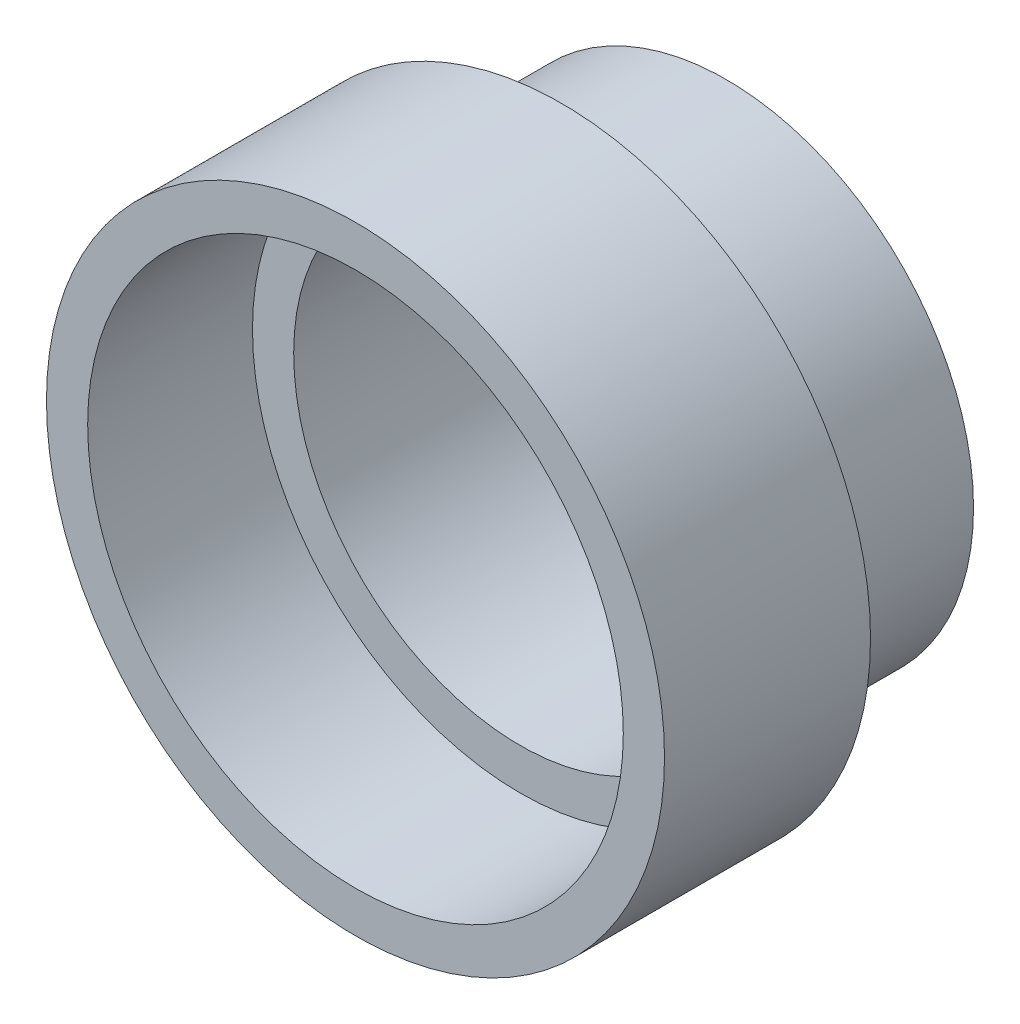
from build123d import *

# Parameters (mm, degrees)
SKETCH1_R           = 15
BOSS_EXTRUDE1_DEPTH = 10
SKETCH2_R           = 13
CUT_EXTRUDE2_DEPTH  = 8
SKETCH4_R           = 12
BOSS_EXTRUDE2_DEPTH = 8
SKETCH5_R           = 11
CUT_EXTRUDE3_DEPTH  = 30


with BuildPart() as part:
    # Sketch1 → Boss-Extrude1 (new body)
    with BuildSketch(Plane.XY):
        Circle(SKETCH1_R)
    extrude(amount=BOSS_EXTRUDE1_DEPTH)

    # Sketch2 → Cut-Extrude2 (cut)
    with BuildSketch(Plane.XY.offset(10)):
        Circle(SKETCH2_R)
    extrude(amount=-CUT_EXTRUDE2_DEPTH, mode=Mode.SUBTRACT)

    # Sketch4 → Boss-Extrude2 (add)
    with BuildSketch(Plane(origin=(0, 0, 0), x_dir=(-1, 0, 0), z_dir=(0, 0, -1))):
        with Locations(Location((0, 0, 0), (0, 0, 180))):
            Circle(SKETCH4_R)
    extrude(amount=BOSS_EXTRUDE2_DEPTH)

    # Sketch5 → Cut-Extrude3 (cut)
    with BuildSketch(Plane(origin=(0, 0, -8), x_dir=(-1, 0, 0), z_dir=(0, 0, -1))):
        Circle(SKETCH5_R)
    extrude(amount=-CUT_EXTRUDE3_DEPTH, mode=Mode.SUBTRACT)


solid = part.part
